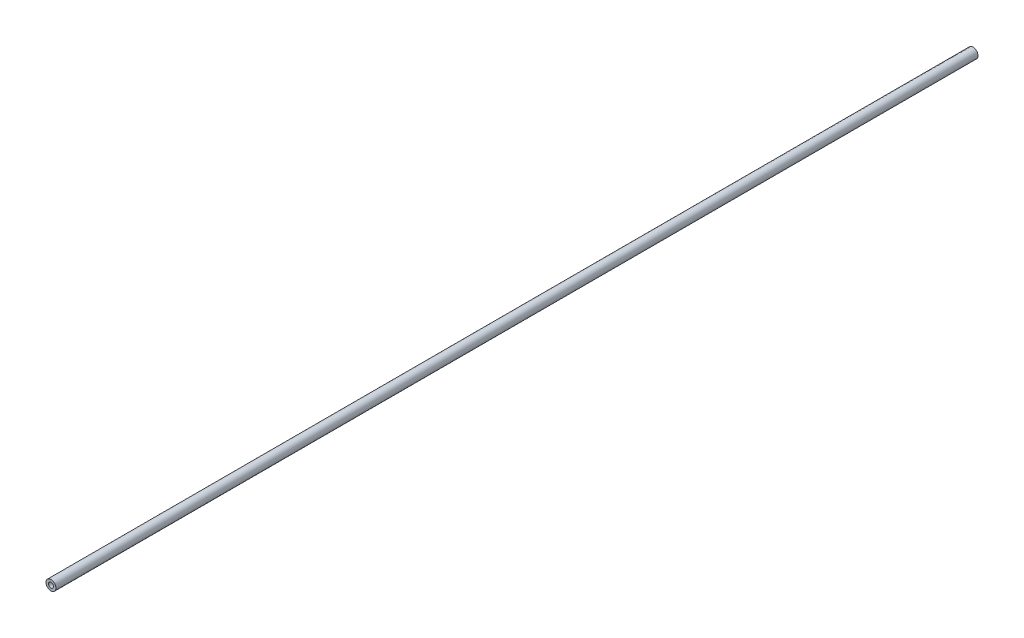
from build123d import *

# Parameters (mm, degrees)
ESQUISSE1_W = 927.6
ESQUISSE1_H = 5


with BuildPart() as part:
    # Esquisse1 → R_volution1 (revolve)
    with BuildSketch(Plane(origin=(0, 0, 0), x_dir=(0, 0, -1), z_dir=(1, 0, 0)), mode=Mode.PRIVATE) as r_volution1_sk:
        with Locations((0, 2.5)):
            Rectangle(ESQUISSE1_W, ESQUISSE1_H)
    revolve(r_volution1_sk.sketch.rotate(Axis((0, 0, 463.8), (0, 0, -1)), 90), axis=Axis((0, 0, 463.8), (0, 0, -1)))

    # Esquisse2 → Trou taraud_ M61 (revolve, cut)
    with BuildSketch(Plane(origin=(0, 0, -463.8), x_dir=(0, 1, 0), z_dir=(1, 0, 0))):
        Polygon((0, 0), (0, 18.502151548), (2.5, 17), (2.5, 0), align=None)
    trou_taraud_m61 = revolve(axis=Axis((0, 0, -470.15), (0, 0, 1)), mode=Mode.SUBTRACT)

    # Sym_trie1: Trou taraud_ M61 across plane
    add(trou_taraud_m61.mirror(Plane.XY), mode=Mode.SUBTRACT)


solid = part.part
